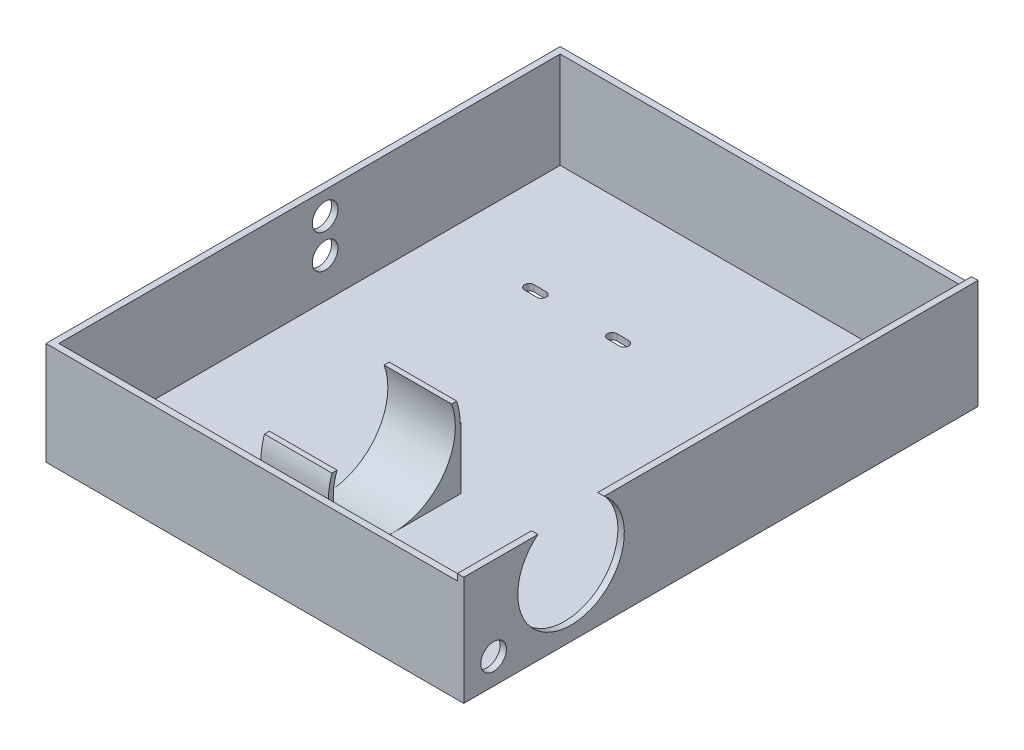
from build123d import *

# Parameters (mm, degrees)
SKETCH_1_W          = 100
SKETCH_1_H          = 100
EXTRUDE_1_DEPTH     = 2
SKETCH_2_W          = 100
SKETCH_2_H          = 60
EXTRUDE_2_DEPTH     = 2
SKETCH_3_W          = 2
SKETCH_3_H          = 160
EXTRUDE_3_DEPTH     = 30
SKETCH_4_R          = 3.905730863
CUT_EXTRUDE_1_DEPTH = 34.9
SKETCH_5_R          = 4
CUT_EXTRUDE_2_DEPTH = 34.9
CUT_EXTRUDE_3_DEPTH = 34.9
SKETCH_7_W          = 30
SKETCH_7_H          = 160
EXTRUDE_4_DEPTH     = 2
SKETCH_10_R         = 20.5
SKETCH_10_R_2       = 19
EXTRUDE_5_DEPTH     = 21
EXTRUDE_START       = -21
EXTRUDE_6_DEPTH     = 21
SKETCH_13_W         = 44.772927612
SKETCH_13_H         = 19.949841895
CUT_EXTRUDE_4_DEPTH = 21
SKETCH_14_W         = 2
SKETCH_14_H         = 160
EXTRUDE_7_DEPTH     = 32
SKETCH_15_R         = 16.577984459
CUT_EXTRUDE_5_DEPTH = 32
SKETCH_16_R         = 4
CUT_EXTRUDE_6_DEPTH = 32
SKETCH_17_W         = 126
SKETCH_17_H         = 2
EXTRUDE_8_DEPTH     = 30
SKETCH_18_W         = 126
SKETCH_18_H         = 2
EXTRUDE_9_DEPTH     = 30


with BuildPart() as part:
    # Sketch 1 → Extrude 1 (new body)
    with BuildSketch(Plane(origin=(0, 0, 0), x_dir=(1, 0, 0), z_dir=(0, 1, 0))):
        with Locations((50, 50)):
            Rectangle(SKETCH_1_W, SKETCH_1_H)
    extrude(amount=EXTRUDE_1_DEPTH)

    # Sketch 2 → Extrude 2 (add)
    with BuildSketch(Plane(origin=(0, 2, 0), x_dir=(1, 0, 0), z_dir=(0, 1, 0))):
        with Locations((50, 130)):
            Rectangle(SKETCH_2_W, SKETCH_2_H)
    extrude(amount=-EXTRUDE_2_DEPTH)

    # Sketch 3 → Extrude 3 (add)
    with BuildSketch(Plane(origin=(0, 2, 0), x_dir=(1, 0, 0), z_dir=(0, 1, 0))):
        with Locations((1, 80)):
            Rectangle(SKETCH_3_W, SKETCH_3_H)
    extrude(amount=EXTRUDE_3_DEPTH)

    # Sketch 4 → Cut-Extrude 1 (cut)
    with BuildSketch(Plane.ZY):
        with Locations((-13.860874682, 14.412458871)):
            Circle(SKETCH_4_R)
    extrude(amount=-CUT_EXTRUDE_1_DEPTH, mode=Mode.SUBTRACT)

    # Sketch 5 → Cut-Extrude 2 (cut)
    with BuildSketch(Plane(origin=(2, 0, 0), x_dir=(0, 0, -1), z_dir=(1, 0, 0))):
        with Locations((84.85411352, 24.843091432)):
            Circle(SKETCH_5_R)
        with Locations((84.85411352, 14.309929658)):
            Circle(SKETCH_5_R)
    extrude(amount=-CUT_EXTRUDE_2_DEPTH, mode=Mode.SUBTRACT)

    # Sketch 6 → Cut-Extrude 3 (cut)
    with BuildSketch(Plane(origin=(0, 2, 0), x_dir=(1, 0, 0), z_dir=(0, 1, 0))):
        with BuildLine():
            Line((33.880844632, 118.810384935), (30.056397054, 118.855273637))
            ThreePointArc((30.056397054, 118.855273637), (28.603642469, 120.342536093), (30.090904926, 121.795290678))
            Line((30.090904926, 121.795290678), (33.915352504, 121.750401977))
            ThreePointArc((33.915352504, 121.750401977), (35.368107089, 120.26313952), (33.880844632, 118.810384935))
        make_face()
        with BuildLine():
            Line((59.87778575, 118.510119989), (56.156295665, 118.553800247))
            ThreePointArc((56.156295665, 118.553800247), (54.708352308, 120.036137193), (56.190689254, 121.48408055))
            Line((56.190689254, 121.48408055), (59.912179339, 121.440400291))
            ThreePointArc((59.912179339, 121.440400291), (61.360122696, 119.958063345), (59.87778575, 118.510119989))
        make_face()
    extrude(amount=-CUT_EXTRUDE_3_DEPTH, mode=Mode.SUBTRACT)

    # Sketch 7 → Extrude 4 (add)
    with BuildSketch(Plane(origin=(0, 2, 0), x_dir=(1, 0, 0), z_dir=(0, 1, 0))):
        with Locations((115, 80)):
            Rectangle(SKETCH_7_W, SKETCH_7_H)
    extrude(amount=-EXTRUDE_4_DEPTH)

    # Sketch 10 → Extrude 5 (add)
    with BuildSketch(Plane(origin=(54, 0, 0), x_dir=(0, 0, -1), z_dir=(1, 0, 0))):
        with Locations((33.37142846, 21)):
            Circle(SKETCH_10_R)
        with Locations(Location((33.37142846, 21, 0), (0, 0, 270))):
            Circle(SKETCH_10_R_2, mode=Mode.SUBTRACT)
    extrude(amount=EXTRUDE_5_DEPTH)

    # Sketch 12 → Extrude 6 (add)
    with BuildSketch(Plane(origin=(75, 0, 0), x_dir=(0, 0, -1), z_dir=(1, 0, 0)).offset(EXTRUDE_START)):
        with BuildLine():
            Line((54.196980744, 21), (53.87142846, 21))
            ThreePointArc((53.87142846, 21), (50.372115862, 9.544580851), (41.068830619, 2))
            Line((41.068830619, 2), (54.196980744, 2))
            Line((54.196980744, 2), (54.196980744, 21))
        make_face()
        with BuildLine():
            ThreePointArc((25.674026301, 2), (16.370741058, 9.544580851), (12.87142846, 21))
            Line((12.87142846, 21), (12.87142846, 2))
            Line((12.87142846, 2), (25.674026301, 2))
        make_face()
    extrude(amount=EXTRUDE_6_DEPTH)

    # Sketch 13 → Cut-Extrude 4 (cut)
    with BuildSketch(Plane(origin=(75, 0, 0), x_dir=(0, 0, -1), z_dir=(1, 0, 0))):
        with Locations((33.061424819, 37.567668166)):
            Rectangle(SKETCH_13_W, SKETCH_13_H)
    extrude(amount=-CUT_EXTRUDE_4_DEPTH, mode=Mode.SUBTRACT)

    # Sketch 14 → Extrude 7 (add)
    with BuildSketch(Plane(origin=(0, 2, 0), x_dir=(1, 0, 0), z_dir=(0, 1, 0))):
        with Locations((129, 80)):
            Rectangle(SKETCH_14_W, SKETCH_14_H)
    extrude(amount=EXTRUDE_7_DEPTH)

    # Sketch 15 → Cut-Extrude 5 (cut)
    with BuildSketch(Plane(origin=(130, 0, 0), x_dir=(0, 0, -1), z_dir=(1, 0, 0))):
        with Locations((33.37142846, 21)):
            Circle(SKETCH_15_R)
    extrude(amount=-CUT_EXTRUDE_5_DEPTH, mode=Mode.SUBTRACT)

    # Sketch 16 → Cut-Extrude 6 (cut)
    with BuildSketch(Plane(origin=(130, 0, 0), x_dir=(0, 0, -1), z_dir=(1, 0, 0))):
        with Locations((9.272648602, 8)):
            Circle(SKETCH_16_R)
    extrude(amount=-CUT_EXTRUDE_6_DEPTH, mode=Mode.SUBTRACT)

    # Sketch 17 → Extrude 8 (add)
    with BuildSketch(Plane(origin=(0, 2, 0), x_dir=(1, 0, 0), z_dir=(0, 1, 0))):
        with Locations((65, 1)):
            Rectangle(SKETCH_17_W, SKETCH_17_H)
    extrude(amount=EXTRUDE_8_DEPTH)

    # Sketch 18 → Extrude 9 (add)
    with BuildSketch(Plane(origin=(0, 2, 0), x_dir=(1, 0, 0), z_dir=(0, 1, 0))):
        with Locations((65, 159)):
            Rectangle(SKETCH_18_W, SKETCH_18_H)
    extrude(amount=EXTRUDE_9_DEPTH)


solid = part.part
